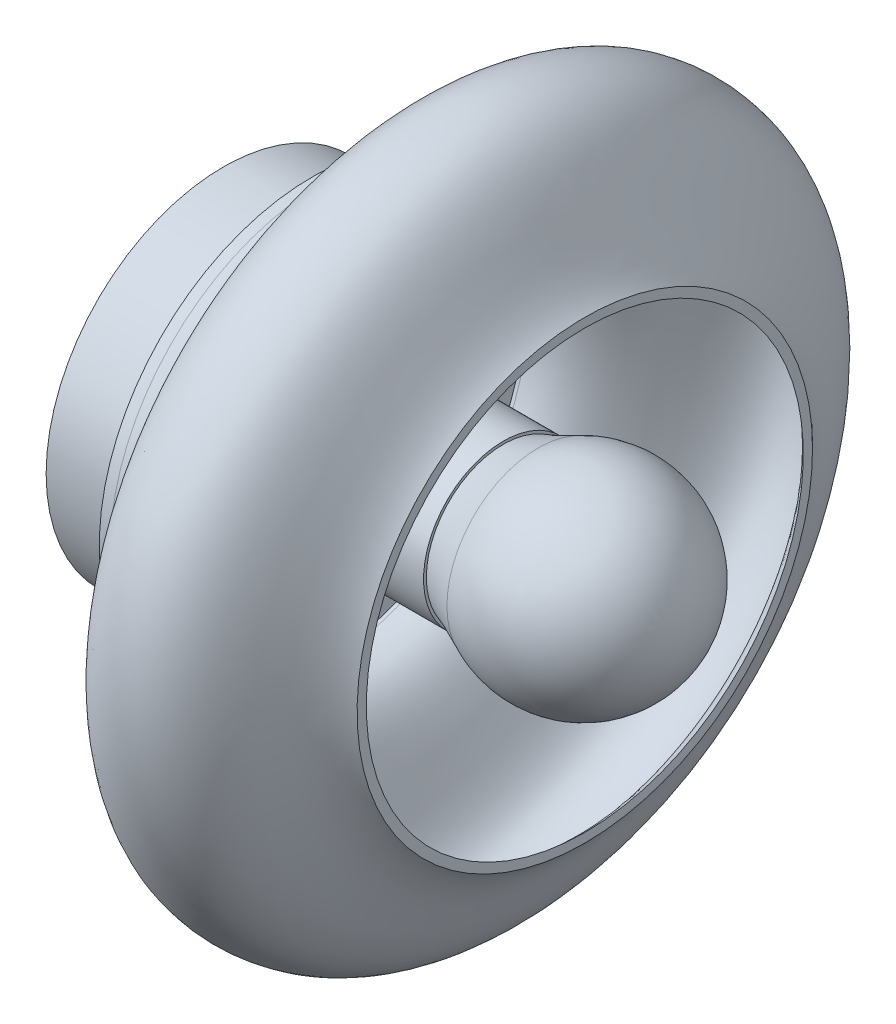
ISO-10303-21;
HEADER;
FILE_DESCRIPTION(('STEP AP214'),'2;1');
FILE_NAME('part.step','',(''),(''),'','','');
FILE_SCHEMA(('AUTOMOTIVE_DESIGN { 1 0 10303 214 1 1 1 1 }'));
ENDSEC;
DATA;
#1=APPLICATION_CONTEXT('core data for automotive mechanical design processes');
#2=APPLICATION_PROTOCOL_DEFINITION('international standard','automotive_design',2000,#1);
#3=PRODUCT_CONTEXT('',#1,'mechanical');
#4=PRODUCT('Part','Part','',(#3));
#5=PRODUCT_RELATED_PRODUCT_CATEGORY('part','',(#4));
#6=PRODUCT_DEFINITION_FORMATION('','',#4);
#7=PRODUCT_DEFINITION_CONTEXT('part definition',#1,'design');
#8=PRODUCT_DEFINITION('design','',#6,#7);
#9=PRODUCT_DEFINITION_SHAPE('','',#8);
#10=(LENGTH_UNIT() NAMED_UNIT(*) SI_UNIT(.MILLI.,.METRE.));
#11=(NAMED_UNIT(*) PLANE_ANGLE_UNIT() SI_UNIT($,.RADIAN.));
#12=(NAMED_UNIT(*) SI_UNIT($,.STERADIAN.) SOLID_ANGLE_UNIT());
#13=UNCERTAINTY_MEASURE_WITH_UNIT(LENGTH_MEASURE(1.E-05),#10,'distance_accuracy_value','');
#14=(GEOMETRIC_REPRESENTATION_CONTEXT(3) GLOBAL_UNCERTAINTY_ASSIGNED_CONTEXT((#13)) GLOBAL_UNIT_ASSIGNED_CONTEXT((#10,
#11,#12)) REPRESENTATION_CONTEXT('',''));
#15=CARTESIAN_POINT('',(0.,0.,0.));
#16=DIRECTION('',(0.,0.,1.));
#17=DIRECTION('',(1.,0.,0.));
#18=AXIS2_PLACEMENT_3D('',#15,#16,#17);
#19=CARTESIAN_POINT('',(-12.3280100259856,17.4140050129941,202.373230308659));
#20=DIRECTION('',(-1.,0.,0.));
#21=DIRECTION('',(0.,0.,1.));
#22=AXIS2_PLACEMENT_3D('',#19,#20,#21);
#23=CYLINDRICAL_SURFACE('',#22,22.5);
#24=CARTESIAN_POINT('',(-12.3280100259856,17.4140050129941,202.373230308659));
#25=DIRECTION('',(1.,0.,0.));
#26=DIRECTION('',(0.,0.,-1.));
#27=AXIS2_PLACEMENT_3D('',#24,#25,#26);
#28=CIRCLE('',#27,22.5);
#29=CARTESIAN_POINT('',(-12.3280100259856,17.4140050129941,179.873230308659));
#30=VERTEX_POINT('',#29);
#31=EDGE_CURVE('P0_E10',#30,#30,#28,.T.);
#32=ORIENTED_EDGE('',*,*,#31,.F.);
#33=EDGE_LOOP('',(#32));
#34=FACE_BOUND('',#33,.T.);
#35=CARTESIAN_POINT('',(-62.3280100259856,17.4140050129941,202.373230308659));
#36=DIRECTION('',(1.,0.,0.));
#37=DIRECTION('',(0.,0.,-1.));
#38=AXIS2_PLACEMENT_3D('',#35,#36,#37);
#39=CIRCLE('',#38,22.5);
#40=CARTESIAN_POINT('',(-62.3280100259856,17.4140050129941,179.873230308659));
#41=VERTEX_POINT('',#40);
#42=EDGE_CURVE('P0_E18',#41,#41,#39,.T.);
#43=ORIENTED_EDGE('',*,*,#42,.T.);
#44=EDGE_LOOP('',(#43));
#45=FACE_BOUND('',#44,.T.);
#46=ADVANCED_FACE('P0_F15',(#34,#45),#23,.T.);
#47=CARTESIAN_POINT('',(-12.3280100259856,17.4140050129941,202.373230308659));
#48=DIRECTION('',(1.,0.,0.));
#49=DIRECTION('',(0.,0.,-1.));
#50=AXIS2_PLACEMENT_3D('',#47,#48,#49);
#51=PLANE('',#50);
#52=CARTESIAN_POINT('',(-12.3280100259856,17.4140050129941,202.373230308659));
#53=DIRECTION('',(1.,0.,0.));
#54=DIRECTION('',(0.,0.,-1.));
#55=AXIS2_PLACEMENT_3D('',#52,#53,#54);
#56=CIRCLE('',#55,21.);
#57=CARTESIAN_POINT('',(-12.3280100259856,17.4140050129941,181.373230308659));
#58=VERTEX_POINT('',#57);
#59=EDGE_CURVE('P0_E25',#58,#58,#56,.T.);
#60=ORIENTED_EDGE('',*,*,#59,.F.);
#61=EDGE_LOOP('',(#60));
#62=FACE_BOUND('',#61,.T.);
#63=ORIENTED_EDGE('',*,*,#31,.T.);
#64=EDGE_LOOP('',(#63));
#65=FACE_BOUND('',#64,.T.);
#66=ADVANCED_FACE('P0_F46',(#62,#65),#51,.T.);
#67=CARTESIAN_POINT('',(-62.3280100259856,17.4140050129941,202.373230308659));
#68=DIRECTION('',(1.,0.,0.));
#69=DIRECTION('',(0.,0.,-1.));
#70=AXIS2_PLACEMENT_3D('',#67,#68,#69);
#71=PLANE('',#70);
#72=ORIENTED_EDGE('',*,*,#42,.F.);
#73=EDGE_LOOP('',(#72));
#74=FACE_BOUND('',#73,.T.);
#75=ADVANCED_FACE('P0_F37',(#74),#71,.F.);
#76=CARTESIAN_POINT('',(-12.3280100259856,17.4140050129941,202.373230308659));
#77=DIRECTION('',(-1.,0.,0.));
#78=DIRECTION('',(0.,0.,1.));
#79=AXIS2_PLACEMENT_3D('',#76,#77,#78);
#80=CYLINDRICAL_SURFACE('',#79,21.);
#81=ORIENTED_EDGE('',*,*,#59,.T.);
#82=EDGE_LOOP('',(#81));
#83=FACE_BOUND('',#82,.T.);
#84=CARTESIAN_POINT('',(-60.8280100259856,17.4140050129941,202.373230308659));
#85=DIRECTION('',(1.,0.,0.));
#86=DIRECTION('',(0.,0.,-1.));
#87=AXIS2_PLACEMENT_3D('',#84,#85,#86);
#88=CIRCLE('',#87,21.);
#89=CARTESIAN_POINT('',(-60.8280100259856,17.4140050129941,181.373230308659));
#90=VERTEX_POINT('',#89);
#91=EDGE_CURVE('P0_E29',#90,#90,#88,.T.);
#92=ORIENTED_EDGE('',*,*,#91,.F.);
#93=EDGE_LOOP('',(#92));
#94=FACE_BOUND('',#93,.T.);
#95=ADVANCED_FACE('P0_F35',(#83,#94),#80,.F.);
#96=CARTESIAN_POINT('',(-60.8280100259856,17.4140050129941,202.373230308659));
#97=DIRECTION('',(1.,0.,0.));
#98=DIRECTION('',(0.,0.,-1.));
#99=AXIS2_PLACEMENT_3D('',#96,#97,#98);
#100=PLANE('',#99);
#101=ORIENTED_EDGE('',*,*,#91,.T.);
#102=EDGE_LOOP('',(#101));
#103=FACE_BOUND('',#102,.T.);
#104=ADVANCED_FACE('P0_F33',(#103),#100,.T.);
#105=CLOSED_SHELL('',(#46,#66,#75,#95,#104));
#106=MANIFOLD_SOLID_BREP('P0_B1',#105);
#107=CARTESIAN_POINT('',(-63.3280100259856,17.4140050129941,202.373230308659));
#108=DIRECTION('',(-1.,0.,0.));
#109=DIRECTION('',(0.,0.,1.));
#110=AXIS2_PLACEMENT_3D('',#107,#108,#109);
#111=CYLINDRICAL_SURFACE('',#110,60.);
#112=CARTESIAN_POINT('',(-63.3280100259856,17.4140050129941,202.373230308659));
#113=DIRECTION('',(1.,0.,0.));
#114=DIRECTION('',(0.,0.,-1.));
#115=AXIS2_PLACEMENT_3D('',#112,#113,#114);
#116=CIRCLE('',#115,60.);
#117=CARTESIAN_POINT('',(-63.3280100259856,17.4140050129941,142.373230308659));
#118=VERTEX_POINT('',#117);
#119=EDGE_CURVE('P1_E10',#118,#118,#116,.T.);
#120=ORIENTED_EDGE('',*,*,#119,.F.);
#121=EDGE_LOOP('',(#120));
#122=FACE_BOUND('',#121,.T.);
#123=CARTESIAN_POINT('',(-66.3280100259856,17.4140050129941,202.373230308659));
#124=DIRECTION('',(1.,0.,0.));
#125=DIRECTION('',(0.,0.,-1.));
#126=AXIS2_PLACEMENT_3D('',#123,#124,#125);
#127=CIRCLE('',#126,60.);
#128=CARTESIAN_POINT('',(-66.3280100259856,17.4140050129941,142.373230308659));
#129=VERTEX_POINT('',#128);
#130=EDGE_CURVE('P1_E22',#129,#129,#127,.T.);
#131=ORIENTED_EDGE('',*,*,#130,.T.);
#132=EDGE_LOOP('',(#131));
#133=FACE_BOUND('',#132,.T.);
#134=ADVANCED_FACE('P1_F15',(#122,#133),#111,.T.);
#135=CARTESIAN_POINT('',(-66.3280100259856,17.4140050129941,202.373230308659));
#136=DIRECTION('',(1.,0.,0.));
#137=DIRECTION('',(0.,0.,-1.));
#138=AXIS2_PLACEMENT_3D('',#135,#136,#137);
#139=PLANE('',#138);
#140=ORIENTED_EDGE('',*,*,#130,.F.);
#141=EDGE_LOOP('',(#140));
#142=FACE_BOUND('',#141,.T.);
#143=ADVANCED_FACE('P1_F44',(#142),#139,.F.);
#144=CARTESIAN_POINT('',(-63.3280100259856,77.4140050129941,202.373230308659));
#145=CARTESIAN_POINT('',(-45.2680341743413,77.4140050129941,202.373230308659));
#146=CARTESIAN_POINT('',(-45.2633605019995,118.600620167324,202.373230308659));
#147=CARTESIAN_POINT('',(2.76132353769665,116.793876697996,202.373230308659));
#148=CARTESIAN_POINT('',(1.12666920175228,77.4140050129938,202.373230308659));
#149=CARTESIAN_POINT('',(21.6719899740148,77.4140050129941,202.373230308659));
#150=B_SPLINE_CURVE_WITH_KNOTS('',3,(#144,#145,#146,#147,#148,#149),.UNSPECIFIED.,.F.,.F.,(4,1,
1,4),(0.,0.394226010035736,0.487518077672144,0.932920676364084),.UNSPECIFIED.);
#151=CARTESIAN_POINT('',(-66.3280100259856,17.4140050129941,202.373230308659));
#152=DIRECTION('',(-1.,0.,0.));
#153=AXIS1_PLACEMENT('',#151,#152);
#154=SURFACE_OF_REVOLUTION('',#150,#153);
#155=CARTESIAN_POINT('',(10.6719899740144,17.4140050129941,202.373230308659));
#156=DIRECTION('',(-1.,0.,0.));
#157=DIRECTION('',(0.,-1.,0.));
#158=AXIS2_PLACEMENT_3D('',#155,#156,#157);
#159=CIRCLE('',#158,64.2569135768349);
#160=CARTESIAN_POINT('',(10.6719899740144,-46.8429085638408,202.373230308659));
#161=VERTEX_POINT('',#160);
#162=EDGE_CURVE('P1_E122',#161,#161,#159,.F.);
#163=ORIENTED_EDGE('',*,*,#162,.F.);
#164=EDGE_LOOP('',(#163));
#165=FACE_BOUND('',#164,.T.);
#166=ORIENTED_EDGE('',*,*,#119,.T.);
#167=EDGE_LOOP('',(#166));
#168=FACE_BOUND('',#167,.T.);
#169=ADVANCED_FACE('P1_F39',(#165,#168),#154,.F.);
#170=CARTESIAN_POINT('',(10.6719899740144,-55.4059307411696,132.373230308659));
#171=DIRECTION('',(-1.,0.,0.));
#172=DIRECTION('',(0.,0.,1.));
#173=AXIS2_PLACEMENT_3D('',#170,#171,#172);
#174=PLANE('',#173);
#175=ORIENTED_EDGE('',*,*,#162,.T.);
#176=EDGE_LOOP('',(#175));
#177=FACE_BOUND('',#176,.T.);
#178=CARTESIAN_POINT('',(10.6719899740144,17.4140050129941,202.373230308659));
#179=DIRECTION('',(-1.,0.,0.));
#180=DIRECTION('',(0.,-1.,0.));
#181=AXIS2_PLACEMENT_3D('',#178,#179,#180);
#182=CIRCLE('',#181,61.6535914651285);
#183=CARTESIAN_POINT('',(10.6719899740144,-44.2395864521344,202.373230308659));
#184=VERTEX_POINT('',#183);
#185=EDGE_CURVE('P1_E18',#184,#184,#182,.F.);
#186=ORIENTED_EDGE('',*,*,#185,.F.);
#187=EDGE_LOOP('',(#186));
#188=FACE_BOUND('',#187,.T.);
#189=ADVANCED_FACE('P1_F43',(#177,#188),#174,.F.);
#190=CARTESIAN_POINT('',(-64.3280100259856,17.4140050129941,202.373230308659));
#191=DIRECTION('',(1.,0.,0.));
#192=DIRECTION('',(0.,0.,-1.));
#193=AXIS2_PLACEMENT_3D('',#190,#191,#192);
#194=PLANE('',#193);
#195=CARTESIAN_POINT('',(-64.3280100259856,17.4140050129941,202.373230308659));
#196=DIRECTION('',(1.,0.,0.));
#197=DIRECTION('',(0.,0.,-1.));
#198=AXIS2_PLACEMENT_3D('',#195,#196,#197);
#199=CIRCLE('',#198,58.);
#200=CARTESIAN_POINT('',(-64.3280100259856,17.4140050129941,144.373230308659));
#201=VERTEX_POINT('',#200);
#202=EDGE_CURVE('P1_E33',#201,#201,#199,.T.);
#203=ORIENTED_EDGE('',*,*,#202,.T.);
#204=EDGE_LOOP('',(#203));
#205=FACE_BOUND('',#204,.T.);
#206=ADVANCED_FACE('P1_F83',(#205),#194,.T.);
#207=CARTESIAN_POINT('',(-63.3280100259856,17.4140050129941,202.373230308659));
#208=DIRECTION('',(-1.,0.,0.));
#209=DIRECTION('',(0.,0.,1.));
#210=AXIS2_PLACEMENT_3D('',#207,#208,#209);
#211=CYLINDRICAL_SURFACE('',#210,58.);
#212=CARTESIAN_POINT('',(-63.3280100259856,17.4140050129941,202.373230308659));
#213=DIRECTION('',(-1.,0.,0.));
#214=DIRECTION('',(0.,1.,0.));
#215=AXIS2_PLACEMENT_3D('',#212,#213,#214);
#216=CIRCLE('',#215,58.);
#217=CARTESIAN_POINT('',(-63.3280100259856,75.4140050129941,202.373230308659));
#218=VERTEX_POINT('',#217);
#219=EDGE_CURVE('P1_E27',#218,#218,#216,.F.);
#220=ORIENTED_EDGE('',*,*,#219,.T.);
#221=EDGE_LOOP('',(#220));
#222=FACE_BOUND('',#221,.T.);
#223=ORIENTED_EDGE('',*,*,#202,.F.);
#224=EDGE_LOOP('',(#223));
#225=FACE_BOUND('',#224,.T.);
#226=ADVANCED_FACE('P1_F93',(#222,#225),#211,.F.);
#227=CARTESIAN_POINT('',(-63.3280100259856,77.4140050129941,202.373230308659));
#228=CARTESIAN_POINT('',(-45.2680341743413,77.4140050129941,202.373230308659));
#229=CARTESIAN_POINT('',(-45.2633605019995,118.600620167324,202.373230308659));
#230=CARTESIAN_POINT('',(2.76132353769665,116.793876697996,202.373230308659));
#231=CARTESIAN_POINT('',(1.12666920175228,77.4140050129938,202.373230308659));
#232=CARTESIAN_POINT('',(21.6719899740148,77.4140050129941,202.373230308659));
#233=B_SPLINE_CURVE_WITH_KNOTS('',3,(#227,#228,#229,#230,#231,#232),.UNSPECIFIED.,.F.,.F.,(4,1,
1,4),(0.,0.394226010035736,0.487518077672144,0.932920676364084),.UNSPECIFIED.);
#234=CARTESIAN_POINT('',(-66.3280100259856,17.4140050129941,202.373230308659));
#235=DIRECTION('',(-1.,0.,0.));
#236=AXIS1_PLACEMENT('',#234,#235);
#237=SURFACE_OF_REVOLUTION('',#233,#236);
#238=OFFSET_SURFACE('',#237,2.,.F.);
#239=ORIENTED_EDGE('',*,*,#185,.T.);
#240=EDGE_LOOP('',(#239));
#241=FACE_BOUND('',#240,.T.);
#242=ORIENTED_EDGE('',*,*,#219,.F.);
#243=EDGE_LOOP('',(#242));
#244=FACE_BOUND('',#243,.T.);
#245=ADVANCED_FACE('P1_F46',(#241,#244),#238,.T.);
#246=CLOSED_SHELL('',(#134,#143,#169,#189,#206,#226,#245));
#247=MANIFOLD_SOLID_BREP('P1_B1',#246);
#248=CARTESIAN_POINT('',(-91.3280100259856,17.4140050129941,202.373230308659));
#249=DIRECTION('',(1.,0.,0.));
#250=DIRECTION('',(0.,0.,-1.));
#251=AXIS2_PLACEMENT_3D('',#248,#249,#250);
#252=CYLINDRICAL_SURFACE('',#251,50.);
#253=CARTESIAN_POINT('',(-91.3280100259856,17.4140050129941,202.373230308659));
#254=DIRECTION('',(-1.,0.,0.));
#255=DIRECTION('',(0.,0.,1.));
#256=AXIS2_PLACEMENT_3D('',#253,#254,#255);
#257=CIRCLE('',#256,50.);
#258=CARTESIAN_POINT('',(-91.3280100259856,17.4140050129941,252.373230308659));
#259=VERTEX_POINT('',#258);
#260=EDGE_CURVE('P2_E10',#259,#259,#257,.T.);
#261=ORIENTED_EDGE('',*,*,#260,.F.);
#262=EDGE_LOOP('',(#261));
#263=FACE_BOUND('',#262,.T.);
#264=CARTESIAN_POINT('',(-66.3280100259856,17.4140050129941,202.373230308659));
#265=DIRECTION('',(-1.,0.,0.));
#266=DIRECTION('',(0.,0.,1.));
#267=AXIS2_PLACEMENT_3D('',#264,#265,#266);
#268=CIRCLE('',#267,50.);
#269=CARTESIAN_POINT('',(-66.3280100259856,17.4140050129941,252.373230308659));
#270=VERTEX_POINT('',#269);
#271=EDGE_CURVE('P2_E18',#270,#270,#268,.T.);
#272=ORIENTED_EDGE('',*,*,#271,.T.);
#273=EDGE_LOOP('',(#272));
#274=FACE_BOUND('',#273,.T.);
#275=ADVANCED_FACE('P2_F15',(#263,#274),#252,.T.);
#276=CARTESIAN_POINT('',(-91.3280100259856,17.4140050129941,202.373230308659));
#277=DIRECTION('',(-1.,0.,0.));
#278=DIRECTION('',(0.,0.,1.));
#279=AXIS2_PLACEMENT_3D('',#276,#277,#278);
#280=PLANE('',#279);
#281=ORIENTED_EDGE('',*,*,#260,.T.);
#282=EDGE_LOOP('',(#281));
#283=FACE_BOUND('',#282,.T.);
#284=ADVANCED_FACE('P2_F30',(#283),#280,.T.);
#285=CARTESIAN_POINT('',(-66.3280100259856,17.4140050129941,202.373230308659));
#286=DIRECTION('',(-1.,0.,0.));
#287=DIRECTION('',(0.,0.,1.));
#288=AXIS2_PLACEMENT_3D('',#285,#286,#287);
#289=PLANE('',#288);
#290=ORIENTED_EDGE('',*,*,#271,.F.);
#291=EDGE_LOOP('',(#290));
#292=FACE_BOUND('',#291,.T.);
#293=ADVANCED_FACE('P2_F28',(#292),#289,.F.);
#294=CLOSED_SHELL('',(#275,#284,#293));
#295=MANIFOLD_SOLID_BREP('P2_B1',#294);
#296=CARTESIAN_POINT('',(-62.3280100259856,17.4140050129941,202.373230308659));
#297=DIRECTION('',(-1.,0.,0.));
#298=DIRECTION('',(0.,0.,1.));
#299=AXIS2_PLACEMENT_3D('',#296,#297,#298);
#300=CYLINDRICAL_SURFACE('',#299,50.);
#301=CARTESIAN_POINT('',(-62.3280100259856,17.4140050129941,202.373230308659));
#302=DIRECTION('',(1.,0.,0.));
#303=DIRECTION('',(0.,0.,-1.));
#304=AXIS2_PLACEMENT_3D('',#301,#302,#303);
#305=CIRCLE('',#304,50.);
#306=CARTESIAN_POINT('',(-62.3280100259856,17.4140050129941,152.373230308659));
#307=VERTEX_POINT('',#306);
#308=EDGE_CURVE('P3_E10',#307,#307,#305,.T.);
#309=ORIENTED_EDGE('',*,*,#308,.F.);
#310=EDGE_LOOP('',(#309));
#311=FACE_BOUND('',#310,.T.);
#312=CARTESIAN_POINT('',(-64.3280100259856,17.4140050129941,202.373230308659));
#313=DIRECTION('',(1.,0.,0.));
#314=DIRECTION('',(0.,0.,-1.));
#315=AXIS2_PLACEMENT_3D('',#312,#313,#314);
#316=CIRCLE('',#315,50.);
#317=CARTESIAN_POINT('',(-64.3280100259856,17.4140050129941,152.373230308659));
#318=VERTEX_POINT('',#317);
#319=EDGE_CURVE('P3_E18',#318,#318,#316,.T.);
#320=ORIENTED_EDGE('',*,*,#319,.T.);
#321=EDGE_LOOP('',(#320));
#322=FACE_BOUND('',#321,.T.);
#323=ADVANCED_FACE('P3_F15',(#311,#322),#300,.T.);
#324=CARTESIAN_POINT('',(-62.3280100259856,17.4140050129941,202.373230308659));
#325=DIRECTION('',(1.,0.,0.));
#326=DIRECTION('',(0.,0.,-1.));
#327=AXIS2_PLACEMENT_3D('',#324,#325,#326);
#328=PLANE('',#327);
#329=ORIENTED_EDGE('',*,*,#308,.T.);
#330=EDGE_LOOP('',(#329));
#331=FACE_BOUND('',#330,.T.);
#332=ADVANCED_FACE('P3_F30',(#331),#328,.T.);
#333=CARTESIAN_POINT('',(-64.3280100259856,17.4140050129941,202.373230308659));
#334=DIRECTION('',(1.,0.,0.));
#335=DIRECTION('',(0.,0.,-1.));
#336=AXIS2_PLACEMENT_3D('',#333,#334,#335);
#337=PLANE('',#336);
#338=ORIENTED_EDGE('',*,*,#319,.F.);
#339=EDGE_LOOP('',(#338));
#340=FACE_BOUND('',#339,.T.);
#341=ADVANCED_FACE('P3_F28',(#340),#337,.F.);
#342=CLOSED_SHELL('',(#323,#332,#341));
#343=MANIFOLD_SOLID_BREP('P3_B1',#342);
#344=CARTESIAN_POINT('',(-35.8280100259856,17.4140050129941,202.373230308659));
#345=DIRECTION('',(1.,0.,0.));
#346=DIRECTION('',(0.,0.,-1.));
#347=AXIS2_PLACEMENT_3D('',#344,#345,#346);
#348=PLANE('',#347);
#349=CARTESIAN_POINT('',(-35.8280100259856,17.4140050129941,202.373230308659));
#350=DIRECTION('',(-1.,0.,0.));
#351=DIRECTION('',(0.,0.,1.));
#352=AXIS2_PLACEMENT_3D('',#349,#350,#351);
#353=CIRCLE('',#352,16.5);
#354=CARTESIAN_POINT('',(-35.8280100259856,17.4140050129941,218.873230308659));
#355=VERTEX_POINT('',#354);
#356=EDGE_CURVE('P4_E22',#355,#355,#353,.T.);
#357=ORIENTED_EDGE('',*,*,#356,.T.);
#358=EDGE_LOOP('',(#357));
#359=FACE_BOUND('',#358,.T.);
#360=ADVANCED_FACE('P4_F16',(#359),#348,.F.);
#361=CARTESIAN_POINT('',(10.1738818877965,17.4140050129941,202.041979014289));
#362=DIRECTION('',(0.,-1.,0.));
#363=DIRECTION('',(0.,0.,1.));
#364=AXIS2_PLACEMENT_3D('',#361,#362,#363);
#365=CIRCLE('',#364,29.);
#366=TRIMMED_CURVE('',#365,(PARAMETER_VALUE(-1.55937361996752)),
(PARAMETER_VALUE(1.55937361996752)),.T.,.PARAMETER.);
#367=CARTESIAN_POINT('',(10.1738818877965,17.4140050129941,202.373230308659));
#368=DIRECTION('',(-1.,0.,0.));
#369=AXIS1_PLACEMENT('',#367,#368);
#370=SURFACE_OF_REVOLUTION('',#366,#369);
#371=CARTESIAN_POINT('',(-2.46761727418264,17.4140050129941,202.373230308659));
#372=DIRECTION('',(-1.,0.,0.));
#373=DIRECTION('',(0.,0.,1.));
#374=AXIS2_PLACEMENT_3D('',#371,#372,#373);
#375=CIRCLE('',#374,25.7684134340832);
#376=CARTESIAN_POINT('',(-2.46761727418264,17.4140050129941,228.141643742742));
#377=VERTEX_POINT('',#376);
#378=EDGE_CURVE('P4_E10',#377,#377,#375,.T.);
#379=ORIENTED_EDGE('',*,*,#378,.F.);
#380=EDGE_LOOP('',(#379));
#381=FACE_BOUND('',#380,.T.);
#382=CARTESIAN_POINT('',(39.1719899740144,17.4140050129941,202.373230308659));
#383=VERTEX_POINT('',#382);
#384=VERTEX_LOOP('',#383);
#385=FACE_BOUND('',#384,.T.);
#386=ADVANCED_FACE('P4_F25',(#381,#385),#370,.T.);
#387=CARTESIAN_POINT('',(-44.6059478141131,17.4140050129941,202.373230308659));
#388=DIRECTION('',(-1.,0.,0.));
#389=DIRECTION('',(0.,0.,1.));
#390=AXIS2_PLACEMENT_3D('',#387,#388,#389);
#391=TOROIDAL_SURFACE('',#390,112.767295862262,96.6666666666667);
#392=ORIENTED_EDGE('',*,*,#356,.F.);
#393=EDGE_LOOP('',(#392));
#394=FACE_BOUND('',#393,.T.);
#395=ORIENTED_EDGE('',*,*,#378,.T.);
#396=EDGE_LOOP('',(#395));
#397=FACE_BOUND('',#396,.T.);
#398=ADVANCED_FACE('P4_F27',(#394,#397),#391,.F.);
#399=CLOSED_SHELL('',(#360,#386,#398));
#400=MANIFOLD_SOLID_BREP('P4_B1',#399);
#401=ADVANCED_BREP_SHAPE_REPRESENTATION('',(#18,#106,#247,#295,#343,#400),#14);
#402=SHAPE_DEFINITION_REPRESENTATION(#9,#401);
ENDSEC;
END-ISO-10303-21;
